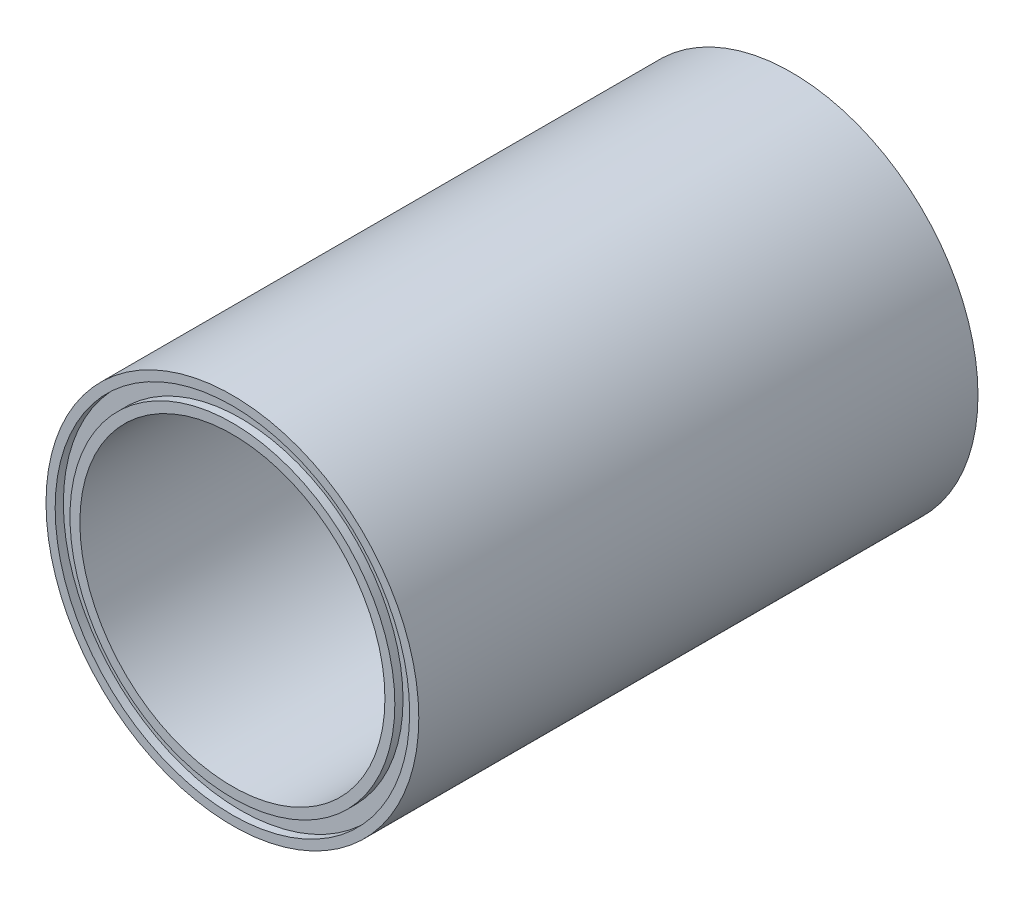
ISO-10303-21;
HEADER;
FILE_DESCRIPTION(('STEP AP214'),'2;1');
FILE_NAME('part.step','',(''),(''),'','','');
FILE_SCHEMA(('AUTOMOTIVE_DESIGN { 1 0 10303 214 1 1 1 1 }'));
ENDSEC;
DATA;
#1=APPLICATION_CONTEXT('core data for automotive mechanical design processes');
#2=APPLICATION_PROTOCOL_DEFINITION('international standard','automotive_design',2000,#1);
#3=PRODUCT_CONTEXT('',#1,'mechanical');
#4=PRODUCT('Part','Part','',(#3));
#5=PRODUCT_RELATED_PRODUCT_CATEGORY('part','',(#4));
#6=PRODUCT_DEFINITION_FORMATION('','',#4);
#7=PRODUCT_DEFINITION_CONTEXT('part definition',#1,'design');
#8=PRODUCT_DEFINITION('design','',#6,#7);
#9=PRODUCT_DEFINITION_SHAPE('','',#8);
#10=(LENGTH_UNIT() NAMED_UNIT(*) SI_UNIT(.MILLI.,.METRE.));
#11=(NAMED_UNIT(*) PLANE_ANGLE_UNIT() SI_UNIT($,.RADIAN.));
#12=(NAMED_UNIT(*) SI_UNIT($,.STERADIAN.) SOLID_ANGLE_UNIT());
#13=UNCERTAINTY_MEASURE_WITH_UNIT(LENGTH_MEASURE(1.E-05),#10,'distance_accuracy_value','');
#14=(GEOMETRIC_REPRESENTATION_CONTEXT(3) GLOBAL_UNCERTAINTY_ASSIGNED_CONTEXT((#13)) GLOBAL_UNIT_ASSIGNED_CONTEXT((#10,
#11,#12)) REPRESENTATION_CONTEXT('',''));
#15=CARTESIAN_POINT('',(0.,0.,0.));
#16=DIRECTION('',(0.,0.,1.));
#17=DIRECTION('',(1.,0.,0.));
#18=AXIS2_PLACEMENT_3D('',#15,#16,#17);
#19=CARTESIAN_POINT('',(0.,0.,-66.675));
#20=DIRECTION('',(0.,0.,1.));
#21=DIRECTION('',(1.,0.,0.));
#22=AXIS2_PLACEMENT_3D('',#19,#20,#21);
#23=PLANE('',#22);
#24=CARTESIAN_POINT('',(0.,0.,-66.675));
#25=DIRECTION('',(0.,0.,1.));
#26=DIRECTION('',(1.,0.,0.));
#27=AXIS2_PLACEMENT_3D('',#24,#25,#26);
#28=CIRCLE('',#27,44.45);
#29=CARTESIAN_POINT('',(44.45,0.,-66.675));
#30=VERTEX_POINT('',#29);
#31=EDGE_CURVE('E39',#30,#30,#28,.T.);
#32=ORIENTED_EDGE('',*,*,#31,.F.);
#33=EDGE_LOOP('',(#32));
#34=FACE_BOUND('',#33,.T.);
#35=CARTESIAN_POINT('',(0.,0.,-66.675));
#36=DIRECTION('',(0.,0.,1.));
#37=DIRECTION('',(1.,0.,0.));
#38=AXIS2_PLACEMENT_3D('',#35,#36,#37);
#39=CIRCLE('',#38,42.2656);
#40=CARTESIAN_POINT('',(42.2656,0.,-66.675));
#41=VERTEX_POINT('',#40);
#42=EDGE_CURVE('E66',#41,#41,#39,.T.);
#43=ORIENTED_EDGE('',*,*,#42,.T.);
#44=EDGE_LOOP('',(#43));
#45=FACE_BOUND('',#44,.T.);
#46=ADVANCED_FACE('F35',(#34,#45),#23,.F.);
#47=CARTESIAN_POINT('',(0.,0.,66.675));
#48=DIRECTION('',(0.,0.,1.));
#49=DIRECTION('',(1.,0.,0.));
#50=AXIS2_PLACEMENT_3D('',#47,#48,#49);
#51=PLANE('',#50);
#52=CARTESIAN_POINT('',(0.,0.,66.675));
#53=DIRECTION('',(0.,0.,1.));
#54=DIRECTION('',(1.,0.,0.));
#55=AXIS2_PLACEMENT_3D('',#52,#53,#54);
#56=CIRCLE('',#55,36.3728);
#57=CARTESIAN_POINT('',(36.3728,0.,66.675));
#58=VERTEX_POINT('',#57);
#59=EDGE_CURVE('E46',#58,#58,#56,.T.);
#60=ORIENTED_EDGE('',*,*,#59,.F.);
#61=EDGE_LOOP('',(#60));
#62=FACE_BOUND('',#61,.T.);
#63=CARTESIAN_POINT('',(0.,0.,66.675));
#64=DIRECTION('',(0.,0.,1.));
#65=DIRECTION('',(1.,0.,0.));
#66=AXIS2_PLACEMENT_3D('',#63,#64,#65);
#67=CIRCLE('',#66,38.735);
#68=CARTESIAN_POINT('',(38.735,0.,66.675));
#69=VERTEX_POINT('',#68);
#70=EDGE_CURVE('E60',#69,#69,#67,.T.);
#71=ORIENTED_EDGE('',*,*,#70,.T.);
#72=EDGE_LOOP('',(#71));
#73=FACE_BOUND('',#72,.T.);
#74=ADVANCED_FACE('F108',(#62,#73),#51,.T.);
#75=CARTESIAN_POINT('',(0.,0.,66.675));
#76=DIRECTION('',(0.,0.,1.));
#77=DIRECTION('',(1.,0.,0.));
#78=AXIS2_PLACEMENT_3D('',#75,#76,#77);
#79=CIRCLE('',#78,42.2656);
#80=CARTESIAN_POINT('',(42.2656,0.,66.675));
#81=VERTEX_POINT('',#80);
#82=EDGE_CURVE('E54',#81,#81,#79,.T.);
#83=ORIENTED_EDGE('',*,*,#82,.F.);
#84=EDGE_LOOP('',(#83));
#85=FACE_BOUND('',#84,.T.);
#86=CARTESIAN_POINT('',(0.,0.,66.675));
#87=DIRECTION('',(0.,0.,1.));
#88=DIRECTION('',(1.,0.,0.));
#89=AXIS2_PLACEMENT_3D('',#86,#87,#88);
#90=CIRCLE('',#89,44.45);
#91=CARTESIAN_POINT('',(44.45,0.,66.675));
#92=VERTEX_POINT('',#91);
#93=EDGE_CURVE('E10',#92,#92,#90,.T.);
#94=ORIENTED_EDGE('',*,*,#93,.T.);
#95=EDGE_LOOP('',(#94));
#96=FACE_BOUND('',#95,.T.);
#97=ADVANCED_FACE('F90',(#85,#96),#51,.T.);
#98=CARTESIAN_POINT('',(0.,0.,-66.675));
#99=DIRECTION('',(0.,0.,1.));
#100=DIRECTION('',(1.,0.,0.));
#101=AXIS2_PLACEMENT_3D('',#98,#99,#100);
#102=CIRCLE('',#101,38.735);
#103=CARTESIAN_POINT('',(38.735,0.,-66.675));
#104=VERTEX_POINT('',#103);
#105=EDGE_CURVE('E72',#104,#104,#102,.T.);
#106=ORIENTED_EDGE('',*,*,#105,.F.);
#107=EDGE_LOOP('',(#106));
#108=FACE_BOUND('',#107,.T.);
#109=CARTESIAN_POINT('',(0.,0.,-66.675));
#110=DIRECTION('',(0.,0.,1.));
#111=DIRECTION('',(1.,0.,0.));
#112=AXIS2_PLACEMENT_3D('',#109,#110,#111);
#113=CIRCLE('',#112,36.3728);
#114=CARTESIAN_POINT('',(36.3728,0.,-66.675));
#115=VERTEX_POINT('',#114);
#116=EDGE_CURVE('E48',#115,#115,#113,.T.);
#117=ORIENTED_EDGE('',*,*,#116,.T.);
#118=EDGE_LOOP('',(#117));
#119=FACE_BOUND('',#118,.T.);
#120=ADVANCED_FACE('F87',(#108,#119),#23,.F.);
#121=CARTESIAN_POINT('',(0.,0.,66.675));
#122=DIRECTION('',(0.,0.,-1.));
#123=DIRECTION('',(-1.,0.,0.));
#124=AXIS2_PLACEMENT_3D('',#121,#122,#123);
#125=CYLINDRICAL_SURFACE('',#124,44.45);
#126=ORIENTED_EDGE('',*,*,#93,.F.);
#127=EDGE_LOOP('',(#126));
#128=FACE_BOUND('',#127,.T.);
#129=ORIENTED_EDGE('',*,*,#31,.T.);
#130=EDGE_LOOP('',(#129));
#131=FACE_BOUND('',#130,.T.);
#132=ADVANCED_FACE('F37',(#128,#131),#125,.T.);
#133=CARTESIAN_POINT('',(0.,0.,66.675));
#134=DIRECTION('',(0.,0.,-1.));
#135=DIRECTION('',(-1.,0.,0.));
#136=AXIS2_PLACEMENT_3D('',#133,#134,#135);
#137=CYLINDRICAL_SURFACE('',#136,36.3728);
#138=ORIENTED_EDGE('',*,*,#59,.T.);
#139=EDGE_LOOP('',(#138));
#140=FACE_BOUND('',#139,.T.);
#141=ORIENTED_EDGE('',*,*,#116,.F.);
#142=EDGE_LOOP('',(#141));
#143=FACE_BOUND('',#142,.T.);
#144=ADVANCED_FACE('F93',(#140,#143),#137,.F.);
#145=CARTESIAN_POINT('',(0.,0.,64.7192));
#146=DIRECTION('',(0.,0.,1.));
#147=DIRECTION('',(1.,0.,0.));
#148=AXIS2_PLACEMENT_3D('',#145,#146,#147);
#149=CYLINDRICAL_SURFACE('',#148,42.2656);
#150=CARTESIAN_POINT('',(0.,0.,64.7192));
#151=DIRECTION('',(0.,0.,1.));
#152=DIRECTION('',(1.,0.,0.));
#153=AXIS2_PLACEMENT_3D('',#150,#151,#152);
#154=CIRCLE('',#153,42.2656);
#155=CARTESIAN_POINT('',(42.2656,0.,64.7192));
#156=VERTEX_POINT('',#155);
#157=EDGE_CURVE('E51',#156,#156,#154,.T.);
#158=ORIENTED_EDGE('',*,*,#157,.F.);
#159=EDGE_LOOP('',(#158));
#160=FACE_BOUND('',#159,.T.);
#161=ORIENTED_EDGE('',*,*,#82,.T.);
#162=EDGE_LOOP('',(#161));
#163=FACE_BOUND('',#162,.T.);
#164=ADVANCED_FACE('F95',(#160,#163),#149,.F.);
#165=CARTESIAN_POINT('',(0.,0.,64.7192));
#166=DIRECTION('',(0.,0.,1.));
#167=DIRECTION('',(1.,0.,0.));
#168=AXIS2_PLACEMENT_3D('',#165,#166,#167);
#169=PLANE('',#168);
#170=CARTESIAN_POINT('',(0.,0.,64.7192));
#171=DIRECTION('',(0.,0.,1.));
#172=DIRECTION('',(1.,0.,0.));
#173=AXIS2_PLACEMENT_3D('',#170,#171,#172);
#174=CIRCLE('',#173,38.735);
#175=CARTESIAN_POINT('',(38.735,0.,64.7192));
#176=VERTEX_POINT('',#175);
#177=EDGE_CURVE('E57',#176,#176,#174,.T.);
#178=ORIENTED_EDGE('',*,*,#177,.F.);
#179=EDGE_LOOP('',(#178));
#180=FACE_BOUND('',#179,.T.);
#181=ORIENTED_EDGE('',*,*,#157,.T.);
#182=EDGE_LOOP('',(#181));
#183=FACE_BOUND('',#182,.T.);
#184=ADVANCED_FACE('F102',(#180,#183),#169,.T.);
#185=CARTESIAN_POINT('',(0.,0.,64.7192));
#186=DIRECTION('',(0.,0.,1.));
#187=DIRECTION('',(1.,0.,0.));
#188=AXIS2_PLACEMENT_3D('',#185,#186,#187);
#189=CYLINDRICAL_SURFACE('',#188,38.735);
#190=ORIENTED_EDGE('',*,*,#177,.T.);
#191=EDGE_LOOP('',(#190));
#192=FACE_BOUND('',#191,.T.);
#193=ORIENTED_EDGE('',*,*,#70,.F.);
#194=EDGE_LOOP('',(#193));
#195=FACE_BOUND('',#194,.T.);
#196=ADVANCED_FACE('F156',(#192,#195),#189,.T.);
#197=CARTESIAN_POINT('',(0.,0.,-64.7192));
#198=DIRECTION('',(0.,0.,-1.));
#199=DIRECTION('',(1.,0.,0.));
#200=AXIS2_PLACEMENT_3D('',#197,#198,#199);
#201=PLANE('',#200);
#202=CARTESIAN_POINT('',(0.,0.,-64.7192));
#203=DIRECTION('',(0.,0.,1.));
#204=DIRECTION('',(1.,0.,0.));
#205=AXIS2_PLACEMENT_3D('',#202,#203,#204);
#206=CIRCLE('',#205,42.2656);
#207=CARTESIAN_POINT('',(42.2656,0.,-64.7192));
#208=VERTEX_POINT('',#207);
#209=EDGE_CURVE('E63',#208,#208,#206,.T.);
#210=ORIENTED_EDGE('',*,*,#209,.F.);
#211=EDGE_LOOP('',(#210));
#212=FACE_BOUND('',#211,.T.);
#213=CARTESIAN_POINT('',(0.,0.,-64.7192));
#214=DIRECTION('',(0.,0.,1.));
#215=DIRECTION('',(1.,0.,0.));
#216=AXIS2_PLACEMENT_3D('',#213,#214,#215);
#217=CIRCLE('',#216,38.735);
#218=CARTESIAN_POINT('',(38.735,0.,-64.7192));
#219=VERTEX_POINT('',#218);
#220=EDGE_CURVE('E69',#219,#219,#217,.T.);
#221=ORIENTED_EDGE('',*,*,#220,.T.);
#222=EDGE_LOOP('',(#221));
#223=FACE_BOUND('',#222,.T.);
#224=ADVANCED_FACE('F78',(#212,#223),#201,.T.);
#225=CARTESIAN_POINT('',(0.,0.,-64.7192));
#226=DIRECTION('',(0.,0.,-1.));
#227=DIRECTION('',(-1.,0.,0.));
#228=AXIS2_PLACEMENT_3D('',#225,#226,#227);
#229=CYLINDRICAL_SURFACE('',#228,42.2656);
#230=ORIENTED_EDGE('',*,*,#209,.T.);
#231=EDGE_LOOP('',(#230));
#232=FACE_BOUND('',#231,.T.);
#233=ORIENTED_EDGE('',*,*,#42,.F.);
#234=EDGE_LOOP('',(#233));
#235=FACE_BOUND('',#234,.T.);
#236=ADVANCED_FACE('F83',(#232,#235),#229,.F.);
#237=CARTESIAN_POINT('',(0.,0.,-64.7192));
#238=DIRECTION('',(0.,0.,-1.));
#239=DIRECTION('',(-1.,0.,0.));
#240=AXIS2_PLACEMENT_3D('',#237,#238,#239);
#241=CYLINDRICAL_SURFACE('',#240,38.735);
#242=ORIENTED_EDGE('',*,*,#220,.F.);
#243=EDGE_LOOP('',(#242));
#244=FACE_BOUND('',#243,.T.);
#245=ORIENTED_EDGE('',*,*,#105,.T.);
#246=EDGE_LOOP('',(#245));
#247=FACE_BOUND('',#246,.T.);
#248=ADVANCED_FACE('F80',(#244,#247),#241,.T.);
#249=CLOSED_SHELL('',(#46,#74,#97,#120,#132,#144,#164,#184,#196,#224,#236,#248));
#250=MANIFOLD_SOLID_BREP('B2',#249);
#251=ADVANCED_BREP_SHAPE_REPRESENTATION('',(#18,#250),#14);
#252=SHAPE_DEFINITION_REPRESENTATION(#9,#251);
ENDSEC;
END-ISO-10303-21;
